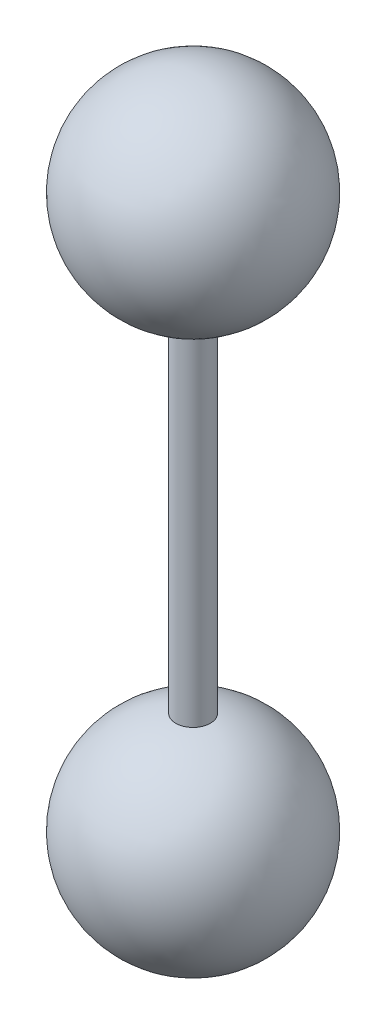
from build123d import *


with BuildPart() as part:
    # Sketch1 → Revolve1 (revolve)
    with BuildSketch(Plane.XY, mode=Mode.PRIVATE) as revolve1_sk:
        with BuildLine():
            Line((0, 0), (0.25, 0))
            Line((0.25, 0), (0.25, 2.520980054))
            ThreePointArc((0.25, 2.520980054), (1.494745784, 4.12543939), (0, 5.5))
            Line((0, 5.5), (0, 0))
        make_face()
    revolve(revolve1_sk.sketch.rotate(Axis((0, 5.5, 0), (0, -1, 0)), 90), axis=Axis((0, 5.5, 0), (0, -1, 0)))

    # Mirror1: part across plane


with BuildPart() as part_1:
    add(part.part)
    add(part.part.mirror(Plane.ZX))


solid = part_1.part
